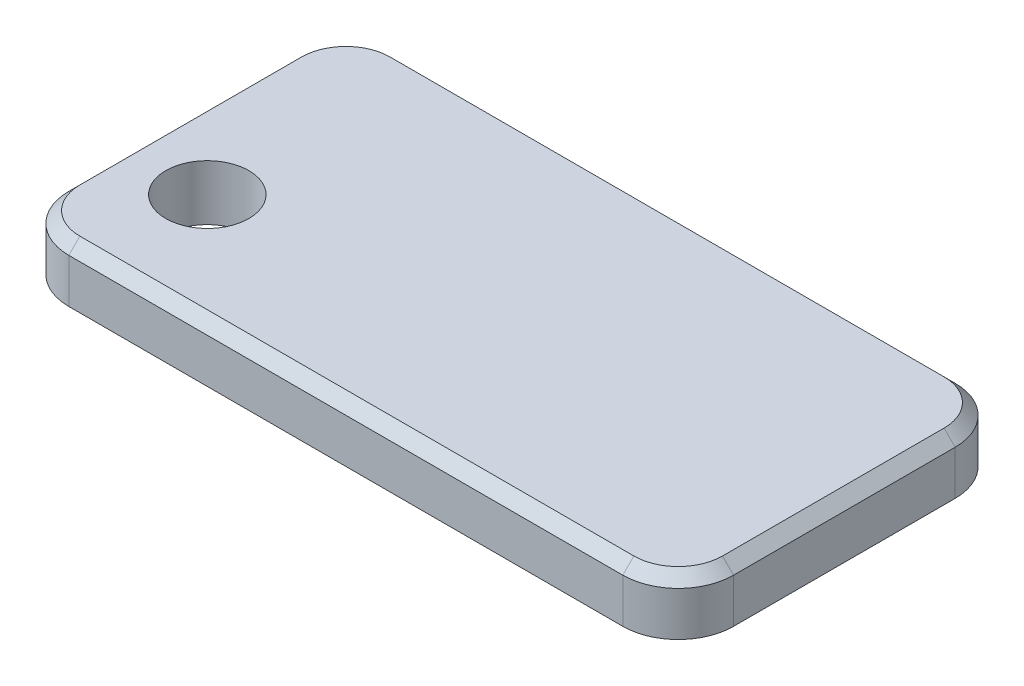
from build123d import *

# Parameters (mm, degrees)
SKETCH1_W          = 152.4
SKETCH1_H          = 76.2
EXTRUDE1_DEPTH     = 12.7
SKETCH2_R          = 9.525
CUT_EXTRUDE1_DEPTH = 171.861025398
FILLET1_R          = 12.7
CHAMFER1_SIZE      = 2.54


with BuildPart() as part:
    # Sketch1 → Extrude1 (new body)
    with BuildSketch(Plane(origin=(0, 0, 0), x_dir=(1, 0, 0), z_dir=(0, 1, 0))):
        with Locations((76.2, 38.1)):
            Rectangle(SKETCH1_W, SKETCH1_H)
    extrude(amount=EXTRUDE1_DEPTH)

    # Sketch2 → Cut-Extrude1 (cut, through all)
    with BuildSketch(Plane(origin=(0, 12.7, 0), x_dir=(-1, 0, 0), z_dir=(0, 1, 0))):
        with Locations(Location((-19.05254, -25.4, 0), (0, 0, 90))):
            Circle(SKETCH2_R)
    extrude(amount=-CUT_EXTRUDE1_DEPTH, mode=Mode.SUBTRACT)

    # Fillet1
    fillet1_edges = [part.edges().sort_by_distance(p)[0] for p in [
        (0, 6.35, -76.2),
        (152.4, 6.35, -76.2),
        (152.4, 6.35, 0),
        (0, 6.35, 0),
    ]]
    fillet(fillet1_edges, radius=FILLET1_R)

    # Chamfer1
    chamfer1_edges = [part.edges().sort_by_distance(p)[0] for p in [
        (76.2, 12.7, -76.2),
        (152.4, 12.7, -38.1),
        (0, 12.7, -38.1),
        (76.2, 12.7, 0),
        (3.719743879, 12.7, -72.480256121),
        (3.719743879, 12.7, -3.719743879),
        (148.680256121, 12.7, -3.719743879),
        (148.680256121, 12.7, -72.480256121),
    ]]
    chamfer(chamfer1_edges, length=CHAMFER1_SIZE)


solid = part.part
